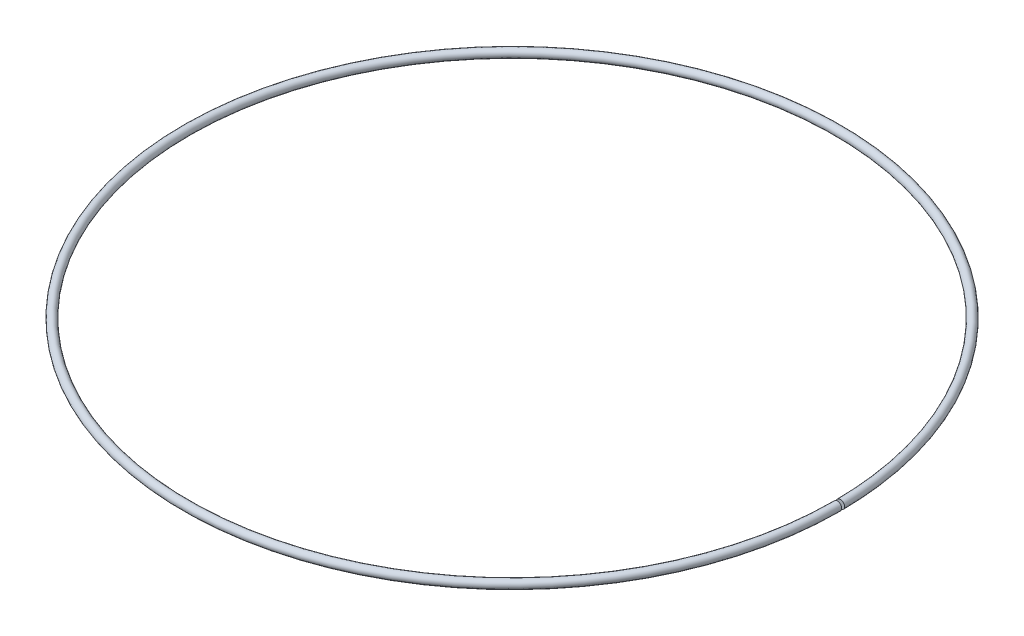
ISO-10303-21;
HEADER;
FILE_DESCRIPTION(('STEP AP214'),'2;1');
FILE_NAME('part.step','',(''),(''),'','','');
FILE_SCHEMA(('AUTOMOTIVE_DESIGN { 1 0 10303 214 1 1 1 1 }'));
ENDSEC;
DATA;
#1=APPLICATION_CONTEXT('core data for automotive mechanical design processes');
#2=APPLICATION_PROTOCOL_DEFINITION('international standard','automotive_design',2000,#1);
#3=PRODUCT_CONTEXT('',#1,'mechanical');
#4=PRODUCT('Part','Part','',(#3));
#5=PRODUCT_RELATED_PRODUCT_CATEGORY('part','',(#4));
#6=PRODUCT_DEFINITION_FORMATION('','',#4);
#7=PRODUCT_DEFINITION_CONTEXT('part definition',#1,'design');
#8=PRODUCT_DEFINITION('design','',#6,#7);
#9=PRODUCT_DEFINITION_SHAPE('','',#8);
#10=(LENGTH_UNIT() NAMED_UNIT(*) SI_UNIT(.MILLI.,.METRE.));
#11=(NAMED_UNIT(*) PLANE_ANGLE_UNIT() SI_UNIT($,.RADIAN.));
#12=(NAMED_UNIT(*) SI_UNIT($,.STERADIAN.) SOLID_ANGLE_UNIT());
#13=UNCERTAINTY_MEASURE_WITH_UNIT(LENGTH_MEASURE(1.E-05),#10,'distance_accuracy_value','');
#14=(GEOMETRIC_REPRESENTATION_CONTEXT(3) GLOBAL_UNCERTAINTY_ASSIGNED_CONTEXT((#13)) GLOBAL_UNIT_ASSIGNED_CONTEXT((#10,
#11,#12)) REPRESENTATION_CONTEXT('',''));
#15=CARTESIAN_POINT('',(0.,0.,0.));
#16=DIRECTION('',(0.,0.,1.));
#17=DIRECTION('',(1.,0.,0.));
#18=AXIS2_PLACEMENT_3D('',#15,#16,#17);
#19=CARTESIAN_POINT('',(0.,0.55,0.));
#20=DIRECTION('',(0.00872653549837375,0.,0.999961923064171));
#21=DIRECTION('',(0.999961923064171,0.,-0.00872653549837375));
#22=AXIS2_PLACEMENT_3D('',#19,#20,#21);
#23=PLANE('',#22);
#24=CARTESIAN_POINT('',(37.9985530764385,0.,-0.331608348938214));
#25=CARTESIAN_POINT('',(37.9985553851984,0.0280690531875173,-0.331608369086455));
#26=CARTESIAN_POINT('',(38.0009253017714,0.0561635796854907,-0.331629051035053));
#27=CARTESIAN_POINT('',(38.0103535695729,0.111603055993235,-0.331711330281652));
#28=CARTESIAN_POINT('',(38.0174219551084,0.138946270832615,-0.331773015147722));
#29=CARTESIAN_POINT('',(38.0360429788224,0.192030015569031,-0.331935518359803));
#30=CARTESIAN_POINT('',(38.0475906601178,0.217772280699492,-0.33203629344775));
#31=CARTESIAN_POINT('',(38.0748445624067,0.266953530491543,-0.332274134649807));
#32=CARTESIAN_POINT('',(38.090551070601,0.290392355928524,-0.332411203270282));
#33=CARTESIAN_POINT('',(38.1256747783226,0.334298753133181,-0.332717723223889));
#34=CARTESIAN_POINT('',(38.1450916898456,0.354766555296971,-0.332887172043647));
#35=CARTESIAN_POINT('',(38.1870877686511,0.392153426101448,-0.333253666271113));
#36=CARTESIAN_POINT('',(38.2096672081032,0.409072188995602,-0.333450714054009));
#37=CARTESIAN_POINT('',(38.2573295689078,0.438868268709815,-0.333866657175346));
#38=CARTESIAN_POINT('',(38.2824107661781,0.451748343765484,-0.33408553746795));
#39=CARTESIAN_POINT('',(38.3344120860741,0.473131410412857,-0.334539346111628));
#40=CARTESIAN_POINT('',(38.3613345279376,0.481628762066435,-0.334774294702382));
#41=CARTESIAN_POINT('',(38.4162065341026,0.493975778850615,-0.335253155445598));
#42=CARTESIAN_POINT('',(38.4441554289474,0.497828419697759,-0.335497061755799));
#43=CARTESIAN_POINT('',(38.5003033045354,0.500786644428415,-0.335987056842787));
#44=CARTESIAN_POINT('',(38.5285022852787,0.499892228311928,-0.336233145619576));
#45=CARTESIAN_POINT('',(38.5843678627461,0.493379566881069,-0.336720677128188));
#46=CARTESIAN_POINT('',(38.612034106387,0.487758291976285,-0.336962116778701));
#47=CARTESIAN_POINT('',(38.6659943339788,0.471957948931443,-0.337433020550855));
#48=CARTESIAN_POINT('',(38.6922900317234,0.46178473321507,-0.337662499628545));
#49=CARTESIAN_POINT('',(38.7428193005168,0.437162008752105,-0.338103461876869));
#50=CARTESIAN_POINT('',(38.7670514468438,0.422709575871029,-0.338314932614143));
#51=CARTESIAN_POINT('',(38.812743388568,0.389942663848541,-0.338713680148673));
#52=CARTESIAN_POINT('',(38.8342034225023,0.371628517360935,-0.338900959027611));
#53=CARTESIAN_POINT('',(38.8737460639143,0.331656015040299,-0.339246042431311));
#54=CARTESIAN_POINT('',(38.8918284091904,0.309997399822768,-0.339403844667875));
#55=CARTESIAN_POINT('',(38.9240990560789,0.263952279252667,-0.339685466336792));
#56=CARTESIAN_POINT('',(38.938287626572,0.239565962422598,-0.339809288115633));
#57=CARTESIAN_POINT('',(38.9623832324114,0.188732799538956,-0.340019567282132));
#58=CARTESIAN_POINT('',(38.9722855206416,0.162283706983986,-0.340105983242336));
#59=CARTESIAN_POINT('',(38.9874867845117,0.108141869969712,-0.340238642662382));
#60=CARTESIAN_POINT('',(38.992795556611,0.0804519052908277,-0.34028497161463));
#61=CARTESIAN_POINT('',(38.9975924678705,0.0350872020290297,-0.340326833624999));
#62=CARTESIAN_POINT('',(38.9985164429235,0.0175485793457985,-0.340334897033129));
#63=CARTESIAN_POINT('',(38.9985126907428,-0.028069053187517,-0.34033486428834));
#64=CARTESIAN_POINT('',(38.9961427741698,-0.0561635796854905,-0.340314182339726));
#65=CARTESIAN_POINT('',(38.9867145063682,-0.111603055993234,-0.340231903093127));
#66=CARTESIAN_POINT('',(38.9796461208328,-0.138946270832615,-0.340170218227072));
#67=CARTESIAN_POINT('',(38.9610250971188,-0.192030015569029,-0.340007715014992));
#68=CARTESIAN_POINT('',(38.9494774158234,-0.217772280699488,-0.339906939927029));
#69=CARTESIAN_POINT('',(38.9222235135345,-0.266953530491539,-0.339669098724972));
#70=CARTESIAN_POINT('',(38.9065170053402,-0.290392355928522,-0.339532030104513));
#71=CARTESIAN_POINT('',(38.8713932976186,-0.334298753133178,-0.339225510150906));
#72=CARTESIAN_POINT('',(38.8519763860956,-0.354766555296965,-0.339056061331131));
#73=CARTESIAN_POINT('',(38.8099803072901,-0.392153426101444,-0.338689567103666));
#74=CARTESIAN_POINT('',(38.7874008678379,-0.409072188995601,-0.338492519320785));
#75=CARTESIAN_POINT('',(38.7397385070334,-0.438868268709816,-0.338076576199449));
#76=CARTESIAN_POINT('',(38.7146573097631,-0.451748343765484,-0.337857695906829));
#77=CARTESIAN_POINT('',(38.6626559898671,-0.473131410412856,-0.337403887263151));
#78=CARTESIAN_POINT('',(38.6357335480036,-0.481628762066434,-0.337168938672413));
#79=CARTESIAN_POINT('',(38.5808615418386,-0.493975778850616,-0.336690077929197));
#80=CARTESIAN_POINT('',(38.5529126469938,-0.497828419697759,-0.33644617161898));
#81=CARTESIAN_POINT('',(38.4967647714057,-0.500786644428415,-0.335956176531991));
#82=CARTESIAN_POINT('',(38.4685657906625,-0.499892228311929,-0.335710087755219));
#83=CARTESIAN_POINT('',(38.4127002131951,-0.493379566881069,-0.335222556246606));
#84=CARTESIAN_POINT('',(38.3850339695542,-0.487758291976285,-0.334981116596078));
#85=CARTESIAN_POINT('',(38.3310737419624,-0.471957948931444,-0.334510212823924));
#86=CARTESIAN_POINT('',(38.3047780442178,-0.461784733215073,-0.33428073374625));
#87=CARTESIAN_POINT('',(38.2542487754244,-0.437162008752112,-0.333839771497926));
#88=CARTESIAN_POINT('',(38.2300166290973,-0.422709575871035,-0.333628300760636));
#89=CARTESIAN_POINT('',(38.1843246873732,-0.389942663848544,-0.333229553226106));
#90=CARTESIAN_POINT('',(38.1628646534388,-0.371628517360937,-0.333042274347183));
#91=CARTESIAN_POINT('',(38.1233220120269,-0.331656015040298,-0.332697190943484));
#92=CARTESIAN_POINT('',(38.1052396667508,-0.309997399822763,-0.332539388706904));
#93=CARTESIAN_POINT('',(38.0729690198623,-0.263952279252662,-0.332257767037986));
#94=CARTESIAN_POINT('',(38.0587804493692,-0.239565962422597,-0.332133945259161));
#95=CARTESIAN_POINT('',(38.0346848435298,-0.188732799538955,-0.331923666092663));
#96=CARTESIAN_POINT('',(38.0247825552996,-0.162283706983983,-0.331837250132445));
#97=CARTESIAN_POINT('',(38.0095812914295,-0.108141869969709,-0.331704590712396));
#98=CARTESIAN_POINT('',(38.0042725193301,-0.0804519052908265,-0.331658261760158));
#99=CARTESIAN_POINT('',(37.9994756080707,-0.0350872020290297,-0.3316163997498));
#100=CARTESIAN_POINT('',(37.9985516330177,-0.0175485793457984,-0.331608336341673));
#101=CARTESIAN_POINT('',(37.9985530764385,0.,-0.331608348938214));
#102=B_SPLINE_CURVE_WITH_KNOTS('',3,(#24,#25,#26,#27,#28,#29,#30,#31,#32,#33,#34,#35,#36,#37,
#38,#39,#40,#41,#42,#43,#44,#45,#46,#47,#48,#49,#50,#51,#52,#53,#54,#55,#56,#57,#58,#59,#60,#61,
#62,#63,#64,#65,#66,#67,#68,#69,#70,#71,#72,#73,#74,#75,#76,#77,#78,#79,#80,#81,#82,#83,#84,#85,
#86,#87,#88,#89,#90,#91,#92,#93,#94,#95,#96,#97,#98,#99,#100,#101),.UNSPECIFIED.,.T.,.F.,(4,2,2,
2,2,2,2,2,2,2,2,2,2,2,2,2,2,2,2,2,2,2,2,2,2,2,2,2,2,2,2,2,2,2,2,2,2,2,4),(0.,0.084152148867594,
0.168484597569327,0.252723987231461,0.336969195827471,0.421207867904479,0.505453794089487,
0.589642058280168,0.673938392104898,0.758180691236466,0.842422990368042,0.926719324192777,
1.01090758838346,1.09515351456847,1.17939218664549,1.26363739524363,1.34787678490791,
1.43220923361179,1.51636138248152,1.5689727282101,1.65312487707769,1.73745732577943,
1.82169671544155,1.90594192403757,1.99018059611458,2.07442652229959,2.15861478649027,
2.242911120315,2.32715341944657,2.41139571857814,2.49569205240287,2.57988031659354,
2.66412624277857,2.74836491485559,2.83261012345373,2.91684951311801,3.00118196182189,
3.08533411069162,3.1379454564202),.UNSPECIFIED.);
#103=CARTESIAN_POINT('',(37.9985530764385,0.,-0.331608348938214));
#104=VERTEX_POINT('',#103);
#105=EDGE_CURVE('E18',#104,#104,#102,.T.);
#106=ORIENTED_EDGE('',*,*,#105,.F.);
#107=EDGE_LOOP('',(#106));
#108=FACE_BOUND('',#107,.T.);
#109=ADVANCED_FACE('F14',(#108),#23,.T.);
#110=CARTESIAN_POINT('',(0.,0.55,0.));
#111=DIRECTION('',(0.,0.,1.));
#112=DIRECTION('',(1.,0.,0.));
#113=AXIS2_PLACEMENT_3D('',#110,#111,#112);
#114=PLANE('',#113);
#115=CARTESIAN_POINT('',(39.,0.,0.));
#116=CARTESIAN_POINT('',(38.9999976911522,0.0280690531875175,0.));
#117=CARTESIAN_POINT('',(38.9976276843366,0.0561635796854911,0.));
#118=CARTESIAN_POINT('',(38.9881990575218,0.111603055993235,0.));
#119=CARTESIAN_POINT('',(38.9811304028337,0.138946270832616,0.));
#120=CARTESIAN_POINT('',(38.9625086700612,0.192030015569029,0.));
#121=CARTESIAN_POINT('',(38.9509605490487,0.217772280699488,0.));
#122=CARTESIAN_POINT('',(38.9237056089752,0.266953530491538,0.));
#123=CARTESIAN_POINT('',(38.9079985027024,0.290392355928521,0.));
#124=CARTESIAN_POINT('',(38.8728734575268,0.334298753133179,0.));
#125=CARTESIAN_POINT('',(38.8534558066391,0.354766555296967,0.));
#126=CARTESIAN_POINT('',(38.8114581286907,0.392153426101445,0.));
#127=CARTESIAN_POINT('',(38.7888778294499,0.409072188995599,0.));
#128=CARTESIAN_POINT('',(38.7412136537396,0.438868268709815,0.));
#129=CARTESIAN_POINT('',(38.7161315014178,0.451748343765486,0.));
#130=CARTESIAN_POINT('',(38.6641282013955,0.47313141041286,0.));
#131=CARTESIAN_POINT('',(38.6372047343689,0.481628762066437,0.));
#132=CARTESIAN_POINT('',(38.5823306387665,0.493975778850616,0.));
#133=CARTESIAN_POINT('',(38.5543806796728,0.49782841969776,0.));
#134=CARTESIAN_POINT('',(38.4982306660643,0.500786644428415,0.));
#135=CARTESIAN_POINT('',(38.4700306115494,0.499892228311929,0.));
#136=CARTESIAN_POINT('',(38.414162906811,0.493379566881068,0.));
#137=CARTESIAN_POINT('',(38.3864956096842,0.487758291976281,0.));
#138=CARTESIAN_POINT('',(38.332533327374,0.47195794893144,0.));
#139=CARTESIAN_POINT('',(38.3062366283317,0.46178473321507,0.));
#140=CARTESIAN_POINT('',(38.2557054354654,0.437162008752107,0.));
#141=CARTESIAN_POINT('',(38.2314723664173,0.422709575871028,0.));
#142=CARTESIAN_POINT('',(38.1857786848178,0.389942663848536,0.));
#143=CARTESIAN_POINT('',(38.1643178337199,0.371628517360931,0.));
#144=CARTESIAN_POINT('',(38.124773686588,0.331656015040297,0.));
#145=CARTESIAN_POINT('',(38.1066906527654,0.309997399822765,0.));
#146=CARTESIAN_POINT('',(38.0744187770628,0.263952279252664,0.));
#147=CARTESIAN_POINT('',(38.0602296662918,0.239565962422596,0.));
#148=CARTESIAN_POINT('',(38.0361331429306,0.188732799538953,0.));
#149=CARTESIAN_POINT('',(38.0262304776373,0.162283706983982,0.));
#150=CARTESIAN_POINT('',(38.0110286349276,0.10814186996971,0.));
#151=CARTESIAN_POINT('',(38.0057196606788,0.0804519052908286,0.));
#152=CARTESIAN_POINT('',(38.0009225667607,0.0350872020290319,0.));
#153=CARTESIAN_POINT('',(37.9999985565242,0.0175485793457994,0.));
#154=CARTESIAN_POINT('',(38.0000023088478,-0.0280690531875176,0.));
#155=CARTESIAN_POINT('',(38.0023723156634,-0.0561635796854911,0.));
#156=CARTESIAN_POINT('',(38.0118009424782,-0.111603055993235,0.));
#157=CARTESIAN_POINT('',(38.0188695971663,-0.138946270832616,0.));
#158=CARTESIAN_POINT('',(38.0374913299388,-0.192030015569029,0.));
#159=CARTESIAN_POINT('',(38.0490394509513,-0.217772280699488,0.));
#160=CARTESIAN_POINT('',(38.0762943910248,-0.266953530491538,0.));
#161=CARTESIAN_POINT('',(38.0920014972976,-0.290392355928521,0.));
#162=CARTESIAN_POINT('',(38.1271265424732,-0.334298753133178,0.));
#163=CARTESIAN_POINT('',(38.1465441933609,-0.354766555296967,0.));
#164=CARTESIAN_POINT('',(38.1885418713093,-0.392153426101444,0.));
#165=CARTESIAN_POINT('',(38.2111221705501,-0.409072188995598,0.));
#166=CARTESIAN_POINT('',(38.2587863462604,-0.438868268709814,0.));
#167=CARTESIAN_POINT('',(38.2838684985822,-0.451748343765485,0.));
#168=CARTESIAN_POINT('',(38.3358717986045,-0.473131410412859,0.));
#169=CARTESIAN_POINT('',(38.3627952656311,-0.481628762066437,0.));
#170=CARTESIAN_POINT('',(38.4176693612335,-0.493975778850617,0.));
#171=CARTESIAN_POINT('',(38.4456193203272,-0.49782841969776,0.));
#172=CARTESIAN_POINT('',(38.5017693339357,-0.500786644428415,0.));
#173=CARTESIAN_POINT('',(38.5299693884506,-0.499892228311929,0.));
#174=CARTESIAN_POINT('',(38.585837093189,-0.493379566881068,0.));
#175=CARTESIAN_POINT('',(38.6135043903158,-0.487758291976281,0.));
#176=CARTESIAN_POINT('',(38.667466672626,-0.47195794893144,0.));
#177=CARTESIAN_POINT('',(38.6937633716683,-0.46178473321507,0.));
#178=CARTESIAN_POINT('',(38.7442945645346,-0.437162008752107,0.));
#179=CARTESIAN_POINT('',(38.7685276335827,-0.422709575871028,0.));
#180=CARTESIAN_POINT('',(38.8142213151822,-0.389942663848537,0.));
#181=CARTESIAN_POINT('',(38.8356821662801,-0.371628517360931,0.));
#182=CARTESIAN_POINT('',(38.875226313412,-0.331656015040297,0.));
#183=CARTESIAN_POINT('',(38.8933093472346,-0.309997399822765,0.));
#184=CARTESIAN_POINT('',(38.9255812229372,-0.263952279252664,0.));
#185=CARTESIAN_POINT('',(38.9397703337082,-0.239565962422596,0.));
#186=CARTESIAN_POINT('',(38.9638668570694,-0.188732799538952,0.));
#187=CARTESIAN_POINT('',(38.9737695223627,-0.162283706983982,0.));
#188=CARTESIAN_POINT('',(38.9889713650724,-0.10814186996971,0.));
#189=CARTESIAN_POINT('',(38.9942803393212,-0.0804519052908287,0.));
#190=CARTESIAN_POINT('',(38.9990774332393,-0.035087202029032,0.));
#191=CARTESIAN_POINT('',(39.0000014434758,-0.0175485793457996,0.));
#192=CARTESIAN_POINT('',(39.,0.,0.));
#193=B_SPLINE_CURVE_WITH_KNOTS('',3,(#115,#116,#117,#118,#119,#120,#121,#122,#123,#124,#125,
#126,#127,#128,#129,#130,#131,#132,#133,#134,#135,#136,#137,#138,#139,#140,#141,#142,#143,#144,
#145,#146,#147,#148,#149,#150,#151,#152,#153,#154,#155,#156,#157,#158,#159,#160,#161,#162,#163,
#164,#165,#166,#167,#168,#169,#170,#171,#172,#173,#174,#175,#176,#177,#178,#179,#180,#181,#182,
#183,#184,#185,#186,#187,#188,#189,#190,#191,#192),.UNSPECIFIED.,.T.,.F.,(4,2,2,2,2,2,2,2,2,2,2,
2,2,2,2,2,2,2,2,2,2,2,2,2,2,2,2,2,2,2,2,2,2,2,2,2,2,2,4),(0.,0.0841521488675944,
0.168484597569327,0.252723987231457,0.336969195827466,0.421207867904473,0.50545379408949,
0.58964205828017,0.673938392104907,0.758180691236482,0.842422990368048,0.926719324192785,
1.01090758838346,1.09515351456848,1.17939218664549,1.26363739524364,1.34787678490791,
1.43220923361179,1.51636138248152,1.5689727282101,1.65312487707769,1.73745732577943,
1.82169671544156,1.90594192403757,1.99018059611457,2.07442652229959,2.15861478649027,
2.24291112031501,2.32715341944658,2.41139571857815,2.49569205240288,2.57988031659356,
2.66412624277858,2.74836491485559,2.83261012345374,2.91684951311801,3.00118196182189,
3.08533411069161,3.1379454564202),.UNSPECIFIED.);
#194=CARTESIAN_POINT('',(39.,0.,0.));
#195=VERTEX_POINT('',#194);
#196=EDGE_CURVE('E10',#195,#195,#193,.T.);
#197=ORIENTED_EDGE('',*,*,#196,.F.);
#198=EDGE_LOOP('',(#197));
#199=FACE_BOUND('',#198,.T.);
#200=ADVANCED_FACE('F32',(#199),#114,.F.);
#201=CARTESIAN_POINT('',(0.,0.,0.));
#202=DIRECTION('',(0.,-1.,0.));
#203=DIRECTION('',(-1.,0.,0.));
#204=AXIS2_PLACEMENT_3D('',#201,#202,#203);
#205=TOROIDAL_SURFACE('',#204,38.5,0.5);
#206=ORIENTED_EDGE('',*,*,#105,.T.);
#207=EDGE_LOOP('',(#206));
#208=FACE_BOUND('',#207,.T.);
#209=ORIENTED_EDGE('',*,*,#196,.T.);
#210=EDGE_LOOP('',(#209));
#211=FACE_BOUND('',#210,.T.);
#212=ADVANCED_FACE('F34',(#208,#211),#205,.T.);
#213=CLOSED_SHELL('',(#109,#200,#212));
#214=MANIFOLD_SOLID_BREP('B1',#213);
#215=ADVANCED_BREP_SHAPE_REPRESENTATION('',(#18,#214),#14);
#216=SHAPE_DEFINITION_REPRESENTATION(#9,#215);
ENDSEC;
END-ISO-10303-21;
